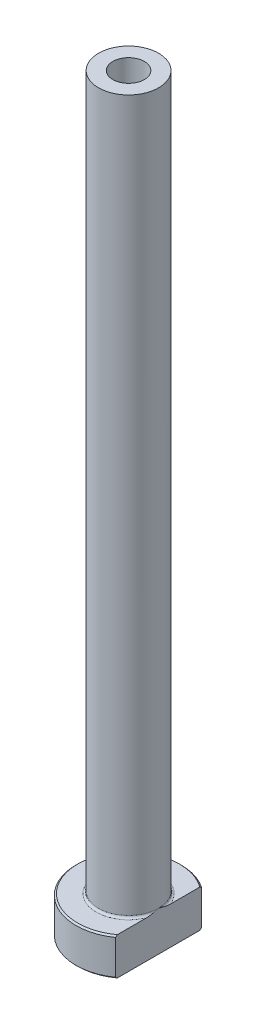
from build123d import *

# Parameters (mm, degrees)
FILLET1_R          = 0.3
CHAMFER1_SIZE      = 0.2
CUT_EXTRUDE1_DEPTH = 101.488805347
CHAMFER2_SIZE      = 0.5


with BuildPart() as part:
    # Sketch1 → Revolve1 (revolve)
    with BuildSketch(Plane.XY, mode=Mode.PRIVATE) as revolve1_sk:
        Polygon((-2.1, 100), (-4, 100), (-4, 5), (-7, 5), (-7, 0), (-2.35, 0), (-2.35, 43), (-2.1, 55), align=None)
    revolve(revolve1_sk.sketch.rotate(Axis((0, 92.187680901, 0), (0, -1, 0)), 270), axis=Axis((0, 92.187680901, 0), (0, -1, 0)))

    # Fillet1
    fillet1_edges = [part.edges().sort_by_distance(p)[0] for p in [
        (0, 5, -4),
    ]]
    fillet(fillet1_edges, radius=FILLET1_R)

    # Chamfer1
    chamfer1_edges = [part.edges().sort_by_distance(p)[0] for p in [
        (0, 0, -7),
        (0, 5, -7),
    ]]
    chamfer(chamfer1_edges, length=CHAMFER1_SIZE)

    # Sketch2 → Cut-Extrude1 (cut, through all)
    with BuildSketch(Plane.XZ):
        with BuildLine():
            Line((4, 5.744562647), (4, -5.744562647))
            ThreePointArc((4, -5.744562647), (7, 0), (4, 5.744562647))
        make_face()
    extrude(amount=-CUT_EXTRUDE1_DEPTH, mode=Mode.SUBTRACT)

    # Chamfer2
    chamfer2_edges = [part.edges().sort_by_distance(p)[0] for p in [
        (0, 0, -2.35),
    ]]
    chamfer(chamfer2_edges, length=CHAMFER2_SIZE)


solid = part.part
